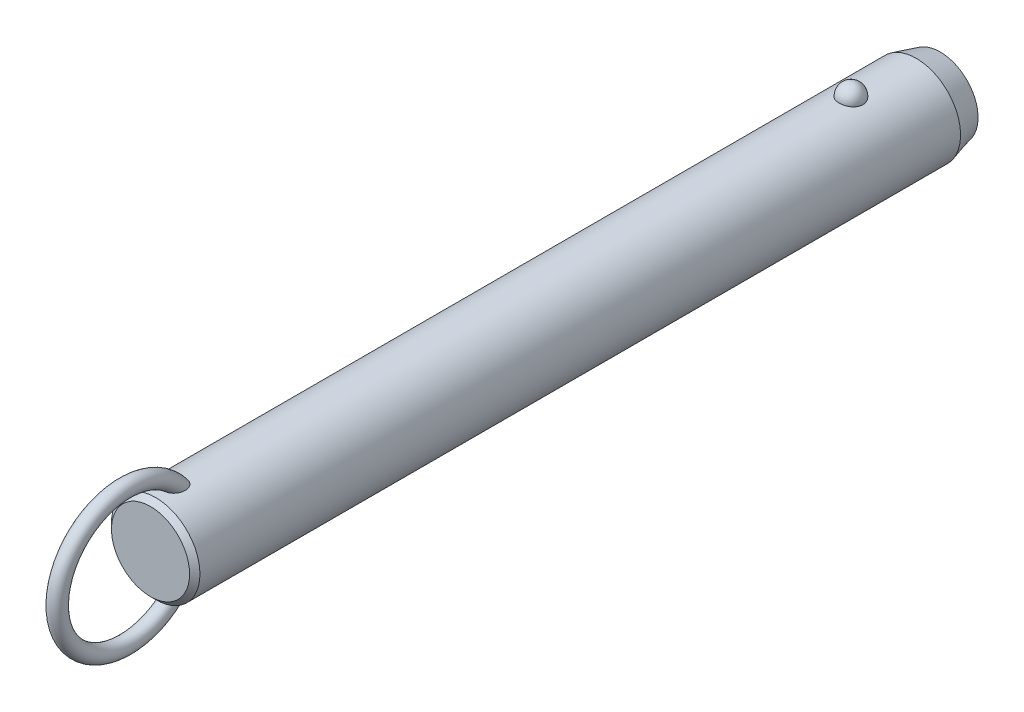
ISO-10303-21;
HEADER;
FILE_DESCRIPTION(('STEP AP214'),'2;1');
FILE_NAME('part.step','',(''),(''),'','','');
FILE_SCHEMA(('AUTOMOTIVE_DESIGN { 1 0 10303 214 1 1 1 1 }'));
ENDSEC;
DATA;
#1=APPLICATION_CONTEXT('core data for automotive mechanical design processes');
#2=APPLICATION_PROTOCOL_DEFINITION('international standard','automotive_design',2000,#1);
#3=PRODUCT_CONTEXT('',#1,'mechanical');
#4=PRODUCT('Part','Part','',(#3));
#5=PRODUCT_RELATED_PRODUCT_CATEGORY('part','',(#4));
#6=PRODUCT_DEFINITION_FORMATION('','',#4);
#7=PRODUCT_DEFINITION_CONTEXT('part definition',#1,'design');
#8=PRODUCT_DEFINITION('design','',#6,#7);
#9=PRODUCT_DEFINITION_SHAPE('','',#8);
#10=(LENGTH_UNIT() NAMED_UNIT(*) SI_UNIT(.MILLI.,.METRE.));
#11=(NAMED_UNIT(*) PLANE_ANGLE_UNIT() SI_UNIT($,.RADIAN.));
#12=(NAMED_UNIT(*) SI_UNIT($,.STERADIAN.) SOLID_ANGLE_UNIT());
#13=UNCERTAINTY_MEASURE_WITH_UNIT(LENGTH_MEASURE(1.E-05),#10,'distance_accuracy_value','');
#14=(GEOMETRIC_REPRESENTATION_CONTEXT(3) GLOBAL_UNCERTAINTY_ASSIGNED_CONTEXT((#13)) GLOBAL_UNIT_ASSIGNED_CONTEXT((#10,
#11,#12)) REPRESENTATION_CONTEXT('',''));
#15=CARTESIAN_POINT('',(0.,0.,0.));
#16=DIRECTION('',(0.,0.,1.));
#17=DIRECTION('',(1.,0.,0.));
#18=AXIS2_PLACEMENT_3D('',#15,#16,#17);
#19=CARTESIAN_POINT('',(0.,0.,160.));
#20=DIRECTION('',(0.,0.,-1.));
#21=DIRECTION('',(-1.,0.,0.));
#22=AXIS2_PLACEMENT_3D('',#19,#20,#21);
#23=CYLINDRICAL_SURFACE('',#22,11.1);
#24=CARTESIAN_POINT('',(2.9724815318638,10.6945945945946,-3.00000000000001));
#25=CARTESIAN_POINT('',(2.97247830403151,10.6945972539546,-2.8322505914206));
#26=CARTESIAN_POINT('',(2.95876598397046,10.6984356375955,-2.66445972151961));
#27=CARTESIAN_POINT('',(2.90424529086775,10.7133624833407,-2.3336238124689));
#28=CARTESIAN_POINT('',(2.8634252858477,10.7244540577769,-2.17058084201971));
#29=CARTESIAN_POINT('',(2.75573657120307,10.7526272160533,-1.85396767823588));
#30=CARTESIAN_POINT('',(2.68887937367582,10.7697061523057,-1.70039333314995));
#31=CARTESIAN_POINT('',(2.53079696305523,10.8079438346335,-1.4069159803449));
#32=CARTESIAN_POINT('',(2.43957264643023,10.8291024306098,-1.26701246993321));
#33=CARTESIAN_POINT('',(2.23458150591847,10.8732541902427,-1.00409565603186));
#34=CARTESIAN_POINT('',(2.12071295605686,10.8962553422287,-0.881162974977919));
#35=CARTESIAN_POINT('',(1.87365402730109,10.9414421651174,-0.656352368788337));
#36=CARTESIAN_POINT('',(1.74046358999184,10.9636278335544,-0.554474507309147));
#37=CARTESIAN_POINT('',(1.45872188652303,11.0046495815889,-0.374872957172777));
#38=CARTESIAN_POINT('',(1.31021276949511,11.0234944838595,-0.297085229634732));
#39=CARTESIAN_POINT('',(1.00170030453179,11.0557957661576,-0.167529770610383));
#40=CARTESIAN_POINT('',(0.841698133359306,11.0692526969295,-0.1157593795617));
#41=CARTESIAN_POINT('',(0.517607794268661,11.0890932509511,-0.0403925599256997));
#42=CARTESIAN_POINT('',(0.353633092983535,11.0955916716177,-0.0163383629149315));
#43=CARTESIAN_POINT('',(0.0238420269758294,11.1011989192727,0.00445177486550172));
#44=CARTESIAN_POINT('',(-0.141974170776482,11.1003084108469,0.00119017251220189));
#45=CARTESIAN_POINT('',(-0.468405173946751,11.0912990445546,-0.0323233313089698));
#46=CARTESIAN_POINT('',(-0.629059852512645,11.0832767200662,-0.062214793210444));
#47=CARTESIAN_POINT('',(-0.942937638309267,11.0609962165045,-0.147645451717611));
#48=CARTESIAN_POINT('',(-1.09616062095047,11.0467379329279,-0.203185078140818));
#49=CARTESIAN_POINT('',(-1.39181061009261,11.0134071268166,-0.338752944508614));
#50=CARTESIAN_POINT('',(-1.53417383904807,10.9943086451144,-0.418913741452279));
#51=CARTESIAN_POINT('',(-1.80342160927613,10.9533667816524,-0.601448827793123));
#52=CARTESIAN_POINT('',(-1.9303046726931,10.9315231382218,-0.703825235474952));
#53=CARTESIAN_POINT('',(-2.16747598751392,10.887005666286,-0.930091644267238));
#54=CARTESIAN_POINT('',(-2.27742774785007,10.8643239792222,-1.05433291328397));
#55=CARTESIAN_POINT('',(-2.47517316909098,10.8209886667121,-1.31966633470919));
#56=CARTESIAN_POINT('',(-2.56296538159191,10.8003351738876,-1.46075958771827));
#57=CARTESIAN_POINT('',(-2.71500300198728,10.7631304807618,-1.75753646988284));
#58=CARTESIAN_POINT('',(-2.77898901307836,10.7466250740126,-1.91335887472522));
#59=CARTESIAN_POINT('',(-2.88046189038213,10.7198747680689,-2.23391529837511));
#60=CARTESIAN_POINT('',(-2.91794947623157,10.709629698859,-2.3986490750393));
#61=CARTESIAN_POINT('',(-2.96537819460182,10.6965949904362,-2.73165170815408));
#62=CARTESIAN_POINT('',(-2.97542891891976,10.693775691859,-2.89990378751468));
#63=CARTESIAN_POINT('',(-2.96804271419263,10.6958279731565,-3.23575286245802));
#64=CARTESIAN_POINT('',(-2.95060646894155,10.7006993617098,-3.4033498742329));
#65=CARTESIAN_POINT('',(-2.88883358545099,10.71753912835,-3.73233906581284));
#66=CARTESIAN_POINT('',(-2.84462026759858,10.7294749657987,-3.89375610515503));
#67=CARTESIAN_POINT('',(-2.73050447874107,10.7590797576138,-4.20667949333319));
#68=CARTESIAN_POINT('',(-2.66060103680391,10.7767489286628,-4.35818546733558));
#69=CARTESIAN_POINT('',(-2.49642559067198,10.8159599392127,-4.64785421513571));
#70=CARTESIAN_POINT('',(-2.40203047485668,10.8375211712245,-4.78594458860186));
#71=CARTESIAN_POINT('',(-2.19143488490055,10.8820570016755,-5.04410382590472));
#72=CARTESIAN_POINT('',(-2.07523364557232,10.9050316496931,-5.16417205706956));
#73=CARTESIAN_POINT('',(-1.82361254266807,10.9499219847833,-5.3833483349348));
#74=CARTESIAN_POINT('',(-1.68812945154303,10.9718338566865,-5.48238464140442));
#75=CARTESIAN_POINT('',(-1.40191298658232,11.0120611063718,-5.65618873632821));
#76=CARTESIAN_POINT('',(-1.25118062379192,11.0303767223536,-5.73095813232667));
#77=CARTESIAN_POINT('',(-0.940570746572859,11.0611653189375,-5.85334725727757));
#78=CARTESIAN_POINT('',(-0.780821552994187,11.0737044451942,-5.90127578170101));
#79=CARTESIAN_POINT('',(-0.455204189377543,11.0918598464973,-5.96992976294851));
#80=CARTESIAN_POINT('',(-0.289336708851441,11.0974768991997,-5.99065827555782));
#81=CARTESIAN_POINT('',(0.0406846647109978,11.1011307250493,-6.00418773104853));
#82=CARTESIAN_POINT('',(0.204817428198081,11.099299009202,-5.9974731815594));
#83=CARTESIAN_POINT('',(0.5295530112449,11.088551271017,-5.95740317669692));
#84=CARTESIAN_POINT('',(0.69015594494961,11.0796354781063,-5.92404858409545));
#85=CARTESIAN_POINT('',(1.0027760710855,11.0557204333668,-5.83180084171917));
#86=CARTESIAN_POINT('',(1.15482001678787,11.0407414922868,-5.7729929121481));
#87=CARTESIAN_POINT('',(1.44678373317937,11.0062913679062,-5.63147366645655));
#88=CARTESIAN_POINT('',(1.58670279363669,10.9868199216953,-5.54876095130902));
#89=CARTESIAN_POINT('',(1.8527023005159,10.9451315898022,-5.36027644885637));
#90=CARTESIAN_POINT('',(1.97855158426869,10.9228788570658,-5.25418644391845));
#91=CARTESIAN_POINT('',(2.21080872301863,10.8782509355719,-5.02251354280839));
#92=CARTESIAN_POINT('',(2.31721312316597,10.8558757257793,-4.89692718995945));
#93=CARTESIAN_POINT('',(2.5094551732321,10.8130715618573,-4.62745408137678));
#94=CARTESIAN_POINT('',(2.59493284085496,10.7926798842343,-4.48330448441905));
#95=CARTESIAN_POINT('',(2.740862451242,10.7565495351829,-4.18236358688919));
#96=CARTESIAN_POINT('',(2.80132490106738,10.7408089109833,-4.02557762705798));
#97=CARTESIAN_POINT('',(2.88959070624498,10.7173718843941,-3.72475308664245));
#98=CARTESIAN_POINT('',(2.92062102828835,10.7088950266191,-3.58171216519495));
#99=CARTESIAN_POINT('',(2.96206765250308,10.6975052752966,-3.29245795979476));
#100=CARTESIAN_POINT('',(2.97248434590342,10.6945922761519,-3.14624473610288));
#101=CARTESIAN_POINT('',(2.9724815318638,10.6945945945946,-3.00000000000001));
#102=B_SPLINE_CURVE_WITH_KNOTS('',3,(#24,#25,#26,#27,#28,#29,#30,#31,#32,#33,#34,#35,#36,#37,
#38,#39,#40,#41,#42,#43,#44,#45,#46,#47,#48,#49,#50,#51,#52,#53,#54,#55,#56,#57,#58,#59,#60,#61,
#62,#63,#64,#65,#66,#67,#68,#69,#70,#71,#72,#73,#74,#75,#76,#77,#78,#79,#80,#81,#82,#83,#84,#85,
#86,#87,#88,#89,#90,#91,#92,#93,#94,#95,#96,#97,#98,#99,#100,#101),.UNSPECIFIED.,.T.,.F.,(4,2,2,
2,2,2,2,2,2,2,2,2,2,2,2,2,2,2,2,2,2,2,2,2,2,2,2,2,2,2,2,2,2,2,2,2,2,2,4),(0.,0.502722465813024,
1.00566079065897,1.5083769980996,2.01107471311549,2.51608392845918,3.02109467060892,
3.52475118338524,4.02835620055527,4.523518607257,5.0186364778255,5.50715297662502,
5.9956776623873,6.48688002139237,6.97812923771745,7.47814366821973,7.9781907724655,
8.48353712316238,8.9888697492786,9.49218093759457,9.99547960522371,10.4964777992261,
10.997494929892,11.5010810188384,12.0046847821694,12.5099796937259,13.0152411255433,
13.5145635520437,14.0138298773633,14.5043200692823,14.9947943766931,15.4836390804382,
15.9725123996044,16.4685040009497,16.9645836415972,17.4686765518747,17.972557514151,
18.410841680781,18.849117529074),.UNSPECIFIED.);
#103=CARTESIAN_POINT('',(2.9724815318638,10.6945945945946,-3.00000000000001));
#104=VERTEX_POINT('',#103);
#105=EDGE_CURVE('E41',#104,#104,#102,.T.);
#106=ORIENTED_EDGE('',*,*,#105,.T.);
#107=EDGE_LOOP('',(#106));
#108=FACE_BOUND('',#107,.T.);
#109=CARTESIAN_POINT('',(0.,0.,171.4));
#110=DIRECTION('',(0.,0.,1.));
#111=DIRECTION('',(1.,0.,0.));
#112=AXIS2_PLACEMENT_3D('',#109,#110,#111);
#113=CIRCLE('',#112,11.1);
#114=CARTESIAN_POINT('',(11.1,0.,171.4));
#115=VERTEX_POINT('',#114);
#116=EDGE_CURVE('E10',#115,#115,#113,.F.);
#117=ORIENTED_EDGE('',*,*,#116,.T.);
#118=EDGE_LOOP('',(#117));
#119=FACE_BOUND('',#118,.T.);
#120=CARTESIAN_POINT('',(-0.564520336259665,-11.0856356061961,163.657815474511));
#121=CARTESIAN_POINT('',(-0.667202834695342,-11.0804062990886,163.691283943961));
#122=CARTESIAN_POINT('',(-0.766875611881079,-11.0738877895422,163.733835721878));
#123=CARTESIAN_POINT('',(-0.957284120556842,-11.0590576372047,163.835419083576));
#124=CARTESIAN_POINT('',(-1.04801616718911,-11.0507452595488,163.89445742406));
#125=CARTESIAN_POINT('',(-1.21800952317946,-11.0333016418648,164.026529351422));
#126=CARTESIAN_POINT('',(-1.29730805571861,-11.0241732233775,164.099515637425));
#127=CARTESIAN_POINT('',(-1.44337665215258,-11.0060026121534,164.257037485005));
#128=CARTESIAN_POINT('',(-1.51014622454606,-10.9969604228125,164.341573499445));
#129=CARTESIAN_POINT('',(-1.63454620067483,-10.9791841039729,164.525521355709));
#130=CARTESIAN_POINT('',(-1.69127003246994,-10.9705107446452,164.625549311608));
#131=CARTESIAN_POINT('',(-1.7898078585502,-10.9548648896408,164.832790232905));
#132=CARTESIAN_POINT('',(-1.83161214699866,-10.9478935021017,164.940007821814));
#133=CARTESIAN_POINT('',(-1.91557028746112,-10.9335803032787,165.205408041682));
#134=CARTESIAN_POINT('',(-1.95040620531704,-10.9273269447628,165.365980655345));
#135=CARTESIAN_POINT('',(-1.99388326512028,-10.9194709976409,165.690697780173));
#136=CARTESIAN_POINT('',(-2.00248051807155,-10.9178762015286,165.854847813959));
#137=CARTESIAN_POINT('',(-1.99551615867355,-10.9191578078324,166.224650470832));
#138=CARTESIAN_POINT('',(-1.97322066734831,-10.9232807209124,166.430191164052));
#139=CARTESIAN_POINT('',(-1.91529761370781,-10.9335244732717,166.733595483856));
#140=CARTESIAN_POINT('',(-1.89184575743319,-10.9376266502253,166.834088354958));
#141=CARTESIAN_POINT('',(-1.83700674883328,-10.9469720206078,167.032855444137));
#142=CARTESIAN_POINT('',(-1.80562070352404,-10.9522150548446,167.131129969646));
#143=CARTESIAN_POINT('',(-1.73463055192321,-10.9636837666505,167.325914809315));
#144=CARTESIAN_POINT('',(-1.69493416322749,-10.9699202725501,167.422390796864));
#145=CARTESIAN_POINT('',(-1.60745141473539,-10.9830806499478,167.611626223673));
#146=CARTESIAN_POINT('',(-1.55966150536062,-10.9900048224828,167.704384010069));
#147=CARTESIAN_POINT('',(-1.45591812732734,-11.0042280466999,167.884690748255));
#148=CARTESIAN_POINT('',(-1.40000013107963,-11.0115253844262,167.972260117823));
#149=CARTESIAN_POINT('',(-1.27937470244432,-11.0261911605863,168.141029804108));
#150=CARTESIAN_POINT('',(-1.21467835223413,-11.0335594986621,168.22223795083));
#151=CARTESIAN_POINT('',(-1.08218150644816,-11.0473027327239,168.369001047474));
#152=CARTESIAN_POINT('',(-1.01522633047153,-11.0537063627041,168.435309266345));
#153=CARTESIAN_POINT('',(-0.872952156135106,-11.065850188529,168.558378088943));
#154=CARTESIAN_POINT('',(-0.797642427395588,-11.0715911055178,168.615149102));
#155=CARTESIAN_POINT('',(-0.651396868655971,-11.081071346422,168.707515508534));
#156=CARTESIAN_POINT('',(-0.581712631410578,-11.0849841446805,168.745049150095));
#157=CARTESIAN_POINT('',(-0.437066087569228,-11.0916271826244,168.808259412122));
#158=CARTESIAN_POINT('',(-0.362109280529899,-11.0943586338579,168.833948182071));
#159=CARTESIAN_POINT('',(-0.207828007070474,-11.0983242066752,168.871117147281));
#160=CARTESIAN_POINT('',(-0.12846771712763,-11.0995432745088,168.882454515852));
#161=CARTESIAN_POINT('',(0.0309101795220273,-11.1002423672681,168.888965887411));
#162=CARTESIAN_POINT('',(0.110927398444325,-11.0997233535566,168.884148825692));
#163=CARTESIAN_POINT('',(0.25640659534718,-11.097240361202,168.860959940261));
#164=CARTESIAN_POINT('',(0.322235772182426,-11.0955074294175,168.844754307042));
#165=CARTESIAN_POINT('',(0.450635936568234,-11.0910350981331,168.802600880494));
#166=CARTESIAN_POINT('',(0.513205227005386,-11.0882951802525,168.776648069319));
#167=CARTESIAN_POINT('',(0.662626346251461,-11.0805620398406,168.702607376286));
#168=CARTESIAN_POINT('',(0.747127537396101,-11.0751144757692,168.649845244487));
#169=CARTESIAN_POINT('',(0.906756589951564,-11.0631932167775,168.531720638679));
#170=CARTESIAN_POINT('',(0.981859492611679,-11.0567168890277,168.466325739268));
#171=CARTESIAN_POINT('',(1.10712207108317,-11.0447856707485,168.34226337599));
#172=CARTESIAN_POINT('',(1.15909566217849,-11.0394280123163,168.285383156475));
#173=CARTESIAN_POINT('',(1.25791923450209,-11.0286040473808,168.167327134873));
#174=CARTESIAN_POINT('',(1.30476642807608,-11.0231376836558,168.106149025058));
#175=CARTESIAN_POINT('',(1.43818612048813,-11.0068027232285,167.917305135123));
#176=CARTESIAN_POINT('',(1.51751767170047,-10.9960104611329,167.784453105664));
#177=CARTESIAN_POINT('',(1.63597546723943,-10.9788847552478,167.553137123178));
#178=CARTESIAN_POINT('',(1.67988876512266,-10.9722190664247,167.457053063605));
#179=CARTESIAN_POINT('',(1.75953241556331,-10.9597298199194,167.261431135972));
#180=CARTESIAN_POINT('',(1.79525967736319,-10.9539065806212,167.161891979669));
#181=CARTESIAN_POINT('',(1.85844731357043,-10.9433632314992,166.96021118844));
#182=CARTESIAN_POINT('',(1.88591073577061,-10.9386427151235,166.85807052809));
#183=CARTESIAN_POINT('',(1.93234324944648,-10.9305350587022,166.651819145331));
#184=CARTESIAN_POINT('',(1.95131065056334,-10.9271481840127,166.547708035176));
#185=CARTESIAN_POINT('',(1.9904020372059,-10.9201183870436,166.265458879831));
#186=CARTESIAN_POINT('',(2.00221217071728,-10.9179256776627,166.086037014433));
#187=CARTESIAN_POINT('',(1.99711676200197,-10.9188636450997,165.727713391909));
#188=CARTESIAN_POINT('',(1.98026150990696,-10.9219849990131,165.548811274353));
#189=CARTESIAN_POINT('',(1.92151657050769,-10.9324473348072,165.23645144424));
#190=CARTESIAN_POINT('',(1.88605081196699,-10.9386915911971,165.101759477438));
#191=CARTESIAN_POINT('',(1.79393020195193,-10.9541780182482,164.839966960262));
#192=CARTESIAN_POINT('',(1.73729868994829,-10.9634168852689,164.712858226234));
#193=CARTESIAN_POINT('',(1.61237037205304,-10.9824218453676,164.489418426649));
#194=CARTESIAN_POINT('',(1.54715374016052,-10.9918945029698,164.391345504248));
#195=CARTESIAN_POINT('',(1.40127026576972,-11.0114415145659,164.207434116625));
#196=CARTESIAN_POINT('',(1.32060742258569,-11.0215157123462,164.121592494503));
#197=CARTESIAN_POINT('',(1.1447478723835,-11.041168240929,163.965163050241));
#198=CARTESIAN_POINT('',(1.04947805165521,-11.0507437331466,163.894656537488));
#199=CARTESIAN_POINT('',(0.847278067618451,-11.0680789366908,163.772640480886));
#200=CARTESIAN_POINT('',(0.740351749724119,-11.0758392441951,163.721124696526));
#201=CARTESIAN_POINT('',(0.529289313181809,-11.0878275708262,163.643485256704));
#202=CARTESIAN_POINT('',(0.425895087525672,-11.0923259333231,163.615377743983));
#203=CARTESIAN_POINT('',(0.215723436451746,-11.0984001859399,163.577703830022));
#204=CARTESIAN_POINT('',(0.10894793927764,-11.0999777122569,163.568127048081));
#205=CARTESIAN_POINT('',(-0.0938962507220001,-11.1000196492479,163.567877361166));
#206=CARTESIAN_POINT('',(-0.189967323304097,-11.0987797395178,163.575408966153));
#207=CARTESIAN_POINT('',(-0.379657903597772,-11.0939111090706,163.605507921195));
#208=CARTESIAN_POINT('',(-0.473277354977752,-11.0902823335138,163.628075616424));
#209=CARTESIAN_POINT('',(-0.564520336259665,-11.0856356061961,163.657815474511));
#210=B_SPLINE_CURVE_WITH_KNOTS('',3,(#120,#121,#122,#123,#124,#125,#126,#127,#128,#129,#130,
#131,#132,#133,#134,#135,#136,#137,#138,#139,#140,#141,#142,#143,#144,#145,#146,#147,#148,#149,
#150,#151,#152,#153,#154,#155,#156,#157,#158,#159,#160,#161,#162,#163,#164,#165,#166,#167,#168,
#169,#170,#171,#172,#173,#174,#175,#176,#177,#178,#179,#180,#181,#182,#183,#184,#185,#186,#187,
#188,#189,#190,#191,#192,#193,#194,#195,#196,#197,#198,#199,#200,#201,#202,#203,#204,#205,#206,
#207,#208,#209),.UNSPECIFIED.,.T.,.F.,(4,2,2,2,2,2,2,2,2,2,2,2,2,2,2,2,2,2,2,2,2,2,2,2,2,2,2,2,
2,2,2,2,2,2,2,2,2,2,2,2,2,2,2,2,4),(0.,0.323999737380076,0.648132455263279,0.971184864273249,
1.29424994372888,1.63886237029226,1.98369857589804,2.47426059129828,2.96564271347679,
3.58257396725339,3.89215258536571,4.20168803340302,4.51486273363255,4.82817514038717,
5.14015911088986,5.45175282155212,5.73442856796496,6.01679375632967,6.25364580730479,
6.49025437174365,6.72919963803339,6.96801276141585,7.17061258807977,7.37331685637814,
7.67094989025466,7.96935728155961,8.20075067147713,8.43226927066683,8.89581623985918,
9.21306533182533,9.5304340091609,9.84768549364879,10.1650000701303,10.7022930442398,
11.2386443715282,11.655339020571,12.071575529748,12.4245637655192,12.7774607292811,
13.1321855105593,13.4867936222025,13.8068771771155,14.1267813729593,14.4146787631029,
14.7025827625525),.UNSPECIFIED.);
#211=CARTESIAN_POINT('',(-0.564520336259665,-11.0856356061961,163.657815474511));
#212=VERTEX_POINT('',#211);
#213=EDGE_CURVE('E59',#212,#212,#210,.T.);
#214=ORIENTED_EDGE('',*,*,#213,.T.);
#215=EDGE_LOOP('',(#214));
#216=FACE_BOUND('',#215,.T.);
#217=CARTESIAN_POINT('',(-0.564520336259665,11.0856356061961,163.657815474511));
#218=CARTESIAN_POINT('',(-0.468542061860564,11.0905203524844,163.626545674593));
#219=CARTESIAN_POINT('',(-0.369793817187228,11.0942886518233,163.603157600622));
#220=CARTESIAN_POINT('',(-0.169555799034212,11.0991586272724,163.573085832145));
#221=CARTESIAN_POINT('',(-0.0680604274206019,11.1002543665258,163.56643932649));
#222=CARTESIAN_POINT('',(0.13454973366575,11.099646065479,163.570157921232));
#223=CARTESIAN_POINT('',(0.235664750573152,11.0979441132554,163.58051033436));
#224=CARTESIAN_POINT('',(0.434632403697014,11.0919342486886,163.617831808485));
#225=CARTESIAN_POINT('',(0.532486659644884,11.0876276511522,163.644792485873));
#226=CARTESIAN_POINT('',(0.722445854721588,11.0768742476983,163.7144096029));
#227=CARTESIAN_POINT('',(0.814543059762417,11.0704246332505,163.757086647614));
#228=CARTESIAN_POINT('',(0.990565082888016,11.0560659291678,163.856648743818));
#229=CARTESIAN_POINT('',(1.07448844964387,11.048156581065,163.913536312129));
#230=CARTESIAN_POINT('',(1.23562672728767,11.0313221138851,164.042210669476));
#231=CARTESIAN_POINT('',(1.3124268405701,11.0223686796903,164.114511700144));
#232=CARTESIAN_POINT('',(1.45398030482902,11.0045918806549,164.270042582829));
#233=CARTESIAN_POINT('',(1.51873073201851,10.9957685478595,164.353275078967));
#234=CARTESIAN_POINT('',(1.64107232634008,10.9782087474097,164.536384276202));
#235=CARTESIAN_POINT('',(1.6974317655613,10.9695572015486,164.637089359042));
#236=CARTESIAN_POINT('',(1.79515063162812,10.9539887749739,164.845626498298));
#237=CARTESIAN_POINT('',(1.83649966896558,10.9470730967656,164.95346343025));
#238=CARTESIAN_POINT('',(1.91931148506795,10.9329211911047,165.220399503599));
#239=CARTESIAN_POINT('',(1.95340104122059,10.9267904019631,165.381861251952));
#240=CARTESIAN_POINT('',(1.99526195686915,10.9192174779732,165.70821631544));
#241=CARTESIAN_POINT('',(2.00298989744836,10.9177830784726,165.87311484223));
#242=CARTESIAN_POINT('',(1.99396251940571,10.9194420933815,166.244100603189));
#243=CARTESIAN_POINT('',(1.97050829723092,10.923774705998,166.45003871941));
#244=CARTESIAN_POINT('',(1.91079643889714,10.9343131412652,166.753901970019));
#245=CARTESIAN_POINT('',(1.88673702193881,10.9385106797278,166.854529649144));
#246=CARTESIAN_POINT('',(1.8306550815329,10.9480376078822,167.053510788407));
#247=CARTESIAN_POINT('',(1.79863369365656,10.9533668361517,167.151864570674));
#248=CARTESIAN_POINT('',(1.72633365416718,10.9649954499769,167.346720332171));
#249=CARTESIAN_POINT('',(1.68596409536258,10.9713053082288,167.44318790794));
#250=CARTESIAN_POINT('',(1.59707998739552,10.9845964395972,167.632323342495));
#251=CARTESIAN_POINT('',(1.54856169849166,10.9915780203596,167.724989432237));
#252=CARTESIAN_POINT('',(1.44330168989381,11.0058935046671,167.904975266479));
#253=CARTESIAN_POINT('',(1.3865974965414,11.0132257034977,167.992316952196));
#254=CARTESIAN_POINT('',(1.26431158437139,11.0279330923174,168.160456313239));
#255=CARTESIAN_POINT('',(1.198741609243,11.0353082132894,168.241262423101));
#256=CARTESIAN_POINT('',(1.06542088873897,11.048931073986,168.385985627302));
#257=CARTESIAN_POINT('',(0.998640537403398,11.0552153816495,168.450784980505));
#258=CARTESIAN_POINT('',(0.856896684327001,11.0671032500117,168.570846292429));
#259=CARTESIAN_POINT('',(0.781942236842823,11.0727075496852,168.626118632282));
#260=CARTESIAN_POINT('',(0.636276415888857,11.081949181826,168.715972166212));
#261=CARTESIAN_POINT('',(0.566755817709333,11.0857572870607,168.752441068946));
#262=CARTESIAN_POINT('',(0.422602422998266,11.0921860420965,168.813533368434));
#263=CARTESIAN_POINT('',(0.347974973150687,11.0948079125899,168.838168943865));
#264=CARTESIAN_POINT('',(0.194593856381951,11.0985608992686,168.873323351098));
#265=CARTESIAN_POINT('',(0.115807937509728,11.0996777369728,168.883706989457));
#266=CARTESIAN_POINT('',(-0.0422499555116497,11.1002003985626,168.888574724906));
#267=CARTESIAN_POINT('',(-0.121521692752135,11.09960699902,168.883066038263));
#268=CARTESIAN_POINT('',(-0.266046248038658,11.0970123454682,168.858827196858));
#269=CARTESIAN_POINT('',(-0.331661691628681,11.0952283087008,168.842135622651));
#270=CARTESIAN_POINT('',(-0.459588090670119,11.0906663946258,168.799111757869));
#271=CARTESIAN_POINT('',(-0.52189737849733,11.0878880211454,168.772774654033));
#272=CARTESIAN_POINT('',(-0.671446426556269,11.0800342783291,168.697513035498));
#273=CARTESIAN_POINT('',(-0.756250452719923,11.0744969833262,168.643818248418));
#274=CARTESIAN_POINT('',(-0.916349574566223,11.0624045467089,168.523802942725));
#275=CARTESIAN_POINT('',(-0.991618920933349,11.0558467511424,168.457449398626));
#276=CARTESIAN_POINT('',(-1.11713140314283,11.0437783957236,168.331633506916));
#277=CARTESIAN_POINT('',(-1.16920539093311,11.0383619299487,168.273952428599));
#278=CARTESIAN_POINT('',(-1.26817476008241,11.02743010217,168.154280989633));
#279=CARTESIAN_POINT('',(-1.31506731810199,11.0219146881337,168.092288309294));
#280=CARTESIAN_POINT('',(-1.40399813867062,11.0109399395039,167.964784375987));
#281=CARTESIAN_POINT('',(-1.44602864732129,11.0054807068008,167.899267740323));
#282=CARTESIAN_POINT('',(-1.52538779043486,10.9947621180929,167.765422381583));
#283=CARTESIAN_POINT('',(-1.56271516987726,10.9895028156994,167.697092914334));
#284=CARTESIAN_POINT('',(-1.64537943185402,10.9774790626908,167.533210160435));
#285=CARTESIAN_POINT('',(-1.68879497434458,10.9708503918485,167.4366735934));
#286=CARTESIAN_POINT('',(-1.76740738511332,10.9584602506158,167.240236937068));
#287=CARTESIAN_POINT('',(-1.80260120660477,10.95269910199,167.14033561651));
#288=CARTESIAN_POINT('',(-1.86468657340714,10.9423003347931,166.937966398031));
#289=CARTESIAN_POINT('',(-1.8915816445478,10.9376622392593,166.835499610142));
#290=CARTESIAN_POINT('',(-1.93682458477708,10.9297405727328,166.628642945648));
#291=CARTESIAN_POINT('',(-1.95517082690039,10.9264572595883,166.524252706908));
#292=CARTESIAN_POINT('',(-1.99232562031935,10.9197647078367,166.24262876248));
#293=CARTESIAN_POINT('',(-2.00294603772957,10.9177914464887,166.064185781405));
#294=CARTESIAN_POINT('',(-1.99566675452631,10.9191290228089,165.707996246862));
#295=CARTESIAN_POINT('',(-1.97781651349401,10.9224306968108,165.53024902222));
#296=CARTESIAN_POINT('',(-1.91747214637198,10.9331592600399,165.219792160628));
#297=CARTESIAN_POINT('',(-1.88131022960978,10.9395108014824,165.085825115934));
#298=CARTESIAN_POINT('',(-1.78790380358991,10.9551659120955,164.82559757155));
#299=CARTESIAN_POINT('',(-1.73068309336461,10.9644661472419,164.699328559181));
#300=CARTESIAN_POINT('',(-1.60475573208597,10.9835398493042,164.47741565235));
#301=CARTESIAN_POINT('',(-1.53908879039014,10.9930297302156,164.380026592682));
#302=CARTESIAN_POINT('',(-1.39238608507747,11.0125708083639,164.197525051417));
#303=CARTESIAN_POINT('',(-1.31135150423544,11.0226219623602,164.112411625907));
#304=CARTESIAN_POINT('',(-1.14382035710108,11.0411991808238,163.96529943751));
#305=CARTESIAN_POINT('',(-1.0585850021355,11.0497792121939,163.90186930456));
#306=CARTESIAN_POINT('',(-0.878723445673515,11.0655285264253,163.790250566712));
#307=CARTESIAN_POINT('',(-0.784123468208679,11.0727015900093,163.742020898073));
#308=CARTESIAN_POINT('',(-0.646163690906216,11.0812501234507,163.686023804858));
#309=CARTESIAN_POINT('',(-0.605595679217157,11.0835451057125,163.671197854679));
#310=CARTESIAN_POINT('',(-0.564520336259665,11.0856356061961,163.657815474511));
#311=B_SPLINE_CURVE_WITH_KNOTS('',3,(#217,#218,#219,#220,#221,#222,#223,#224,#225,#226,#227,
#228,#229,#230,#231,#232,#233,#234,#235,#236,#237,#238,#239,#240,#241,#242,#243,#244,#245,#246,
#247,#248,#249,#250,#251,#252,#253,#254,#255,#256,#257,#258,#259,#260,#261,#262,#263,#264,#265,
#266,#267,#268,#269,#270,#271,#272,#273,#274,#275,#276,#277,#278,#279,#280,#281,#282,#283,#284,
#285,#286,#287,#288,#289,#290,#291,#292,#293,#294,#295,#296,#297,#298,#299,#300,#301,#302,#303,
#304,#305,#306,#307,#308,#309,#310),.UNSPECIFIED.,.T.,.F.,(4,2,2,2,2,2,2,2,2,2,2,2,2,2,2,2,2,2,
2,2,2,2,2,2,2,2,2,2,2,2,2,2,2,2,2,2,2,2,2,2,2,2,2,2,2,2,4),(0.,0.303061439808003,
0.606795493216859,0.910302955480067,1.21365733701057,1.51741085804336,1.82121821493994,
2.13745205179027,2.45376252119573,2.79958678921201,3.14564996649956,3.63832391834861,
4.13180893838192,4.75031912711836,5.06071926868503,5.37107516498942,5.68500772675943,
5.99908475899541,6.31176519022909,6.62403542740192,6.90315673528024,7.18197194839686,
7.41687778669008,7.65154134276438,7.88841587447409,8.12518286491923,8.32752842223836,
8.52997509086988,8.82986421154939,9.13054668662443,9.36393502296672,9.59744991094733,
9.83133221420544,10.0652767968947,10.383032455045,10.7009056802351,11.0186436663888,
11.3364420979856,11.8705925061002,12.4038159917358,12.8189662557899,13.2336487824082,
13.5857049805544,13.9377340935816,14.2561354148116,14.5736690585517,14.7033687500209),.UNSPECIFIED.);
#312=CARTESIAN_POINT('',(-0.564520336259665,11.0856356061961,163.657815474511));
#313=VERTEX_POINT('',#312);
#314=EDGE_CURVE('E67',#313,#313,#311,.T.);
#315=ORIENTED_EDGE('',*,*,#314,.T.);
#316=EDGE_LOOP('',(#315));
#317=FACE_BOUND('',#316,.T.);
#318=CARTESIAN_POINT('',(0.,0.,-19.3999999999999));
#319=DIRECTION('',(0.,0.,-1.));
#320=DIRECTION('',(-1.,0.,0.));
#321=AXIS2_PLACEMENT_3D('',#318,#319,#320);
#322=CIRCLE('',#321,11.1);
#323=CARTESIAN_POINT('',(-11.1,0.,-19.3999999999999));
#324=VERTEX_POINT('',#323);
#325=EDGE_CURVE('E56',#324,#324,#322,.F.);
#326=ORIENTED_EDGE('',*,*,#325,.T.);
#327=EDGE_LOOP('',(#326));
#328=FACE_BOUND('',#327,.T.);
#329=ADVANCED_FACE('F37',(#108,#119,#216,#317,#328),#23,.T.);
#330=CARTESIAN_POINT('',(0.,0.,-25.4));
#331=DIRECTION('',(0.,0.,-1.));
#332=DIRECTION('',(-1.,0.,0.));
#333=AXIS2_PLACEMENT_3D('',#330,#331,#332);
#334=PLANE('',#333);
#335=CARTESIAN_POINT('',(0.,0.,-25.4));
#336=DIRECTION('',(0.,0.,-1.));
#337=DIRECTION('',(-1.,0.,0.));
#338=AXIS2_PLACEMENT_3D('',#335,#336,#337);
#339=CIRCLE('',#338,9.49230484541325);
#340=CARTESIAN_POINT('',(-9.49230484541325,0.,-25.4));
#341=VERTEX_POINT('',#340);
#342=EDGE_CURVE('E66',#341,#341,#339,.T.);
#343=ORIENTED_EDGE('',*,*,#342,.T.);
#344=EDGE_LOOP('',(#343));
#345=FACE_BOUND('',#344,.T.);
#346=ADVANCED_FACE('F85',(#345),#334,.T.);
#347=CARTESIAN_POINT('',(0.,0.,-25.4));
#348=DIRECTION('',(0.,0.,1.));
#349=DIRECTION('',(1.,0.,0.));
#350=AXIS2_PLACEMENT_3D('',#347,#348,#349);
#351=CONICAL_SURFACE('',#350,9.49230484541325,0.261799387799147);
#352=ORIENTED_EDGE('',*,*,#325,.F.);
#353=EDGE_LOOP('',(#352));
#354=FACE_BOUND('',#353,.T.);
#355=ORIENTED_EDGE('',*,*,#342,.F.);
#356=EDGE_LOOP('',(#355));
#357=FACE_BOUND('',#356,.T.);
#358=ADVANCED_FACE('F83',(#354,#357),#351,.T.);
#359=CARTESIAN_POINT('',(0.,0.,172.7));
#360=DIRECTION('',(0.,0.,1.));
#361=DIRECTION('',(1.,0.,0.));
#362=AXIS2_PLACEMENT_3D('',#359,#360,#361);
#363=PLANE('',#362);
#364=CARTESIAN_POINT('',(0.,0.,172.7));
#365=DIRECTION('',(0.,0.,1.));
#366=DIRECTION('',(1.,0.,0.));
#367=AXIS2_PLACEMENT_3D('',#364,#365,#366);
#368=CIRCLE('',#367,9.80000000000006);
#369=CARTESIAN_POINT('',(9.80000000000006,0.,172.7));
#370=VERTEX_POINT('',#369);
#371=EDGE_CURVE('E50',#370,#370,#368,.T.);
#372=ORIENTED_EDGE('',*,*,#371,.T.);
#373=EDGE_LOOP('',(#372));
#374=FACE_BOUND('',#373,.T.);
#375=ADVANCED_FACE('F77',(#374),#363,.T.);
#376=CARTESIAN_POINT('',(0.,0.,179.05));
#377=DIRECTION('',(1.,0.,0.));
#378=DIRECTION('',(0.,0.,-1.));
#379=AXIS2_PLACEMENT_3D('',#376,#377,#378);
#380=TOROIDAL_SURFACE('',#379,17.05,2.);
#381=ORIENTED_EDGE('',*,*,#314,.F.);
#382=EDGE_LOOP('',(#381));
#383=FACE_BOUND('',#382,.T.);
#384=ORIENTED_EDGE('',*,*,#213,.F.);
#385=EDGE_LOOP('',(#384));
#386=FACE_BOUND('',#385,.T.);
#387=ADVANCED_FACE('F73',(#383,#386),#380,.T.);
#388=CARTESIAN_POINT('',(0.,0.,172.7));
#389=DIRECTION('',(0.,0.,-1.));
#390=DIRECTION('',(-1.,0.,0.));
#391=AXIS2_PLACEMENT_3D('',#388,#389,#390);
#392=CONICAL_SURFACE('',#391,9.80000000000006,0.785398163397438);
#393=ORIENTED_EDGE('',*,*,#116,.F.);
#394=EDGE_LOOP('',(#393));
#395=FACE_BOUND('',#394,.T.);
#396=ORIENTED_EDGE('',*,*,#371,.F.);
#397=EDGE_LOOP('',(#396));
#398=FACE_BOUND('',#397,.T.);
#399=ADVANCED_FACE('F39',(#395,#398),#392,.T.);
#400=CARTESIAN_POINT('',(0.,11.1,-3.00000000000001));
#401=DIRECTION('',(0.,1.,0.));
#402=DIRECTION('',(0.,0.,-1.));
#403=AXIS2_PLACEMENT_3D('',#400,#401,#402);
#404=SPHERICAL_SURFACE('',#403,3.);
#405=ORIENTED_EDGE('',*,*,#105,.F.);
#406=EDGE_LOOP('',(#405));
#407=FACE_BOUND('',#406,.T.);
#408=ADVANCED_FACE('F79',(#407),#404,.T.);
#409=CLOSED_SHELL('',(#329,#346,#358,#375,#387,#399,#408));
#410=MANIFOLD_SOLID_BREP('B2',#409);
#411=ADVANCED_BREP_SHAPE_REPRESENTATION('',(#18,#410),#14);
#412=SHAPE_DEFINITION_REPRESENTATION(#9,#411);
ENDSEC;
END-ISO-10303-21;
